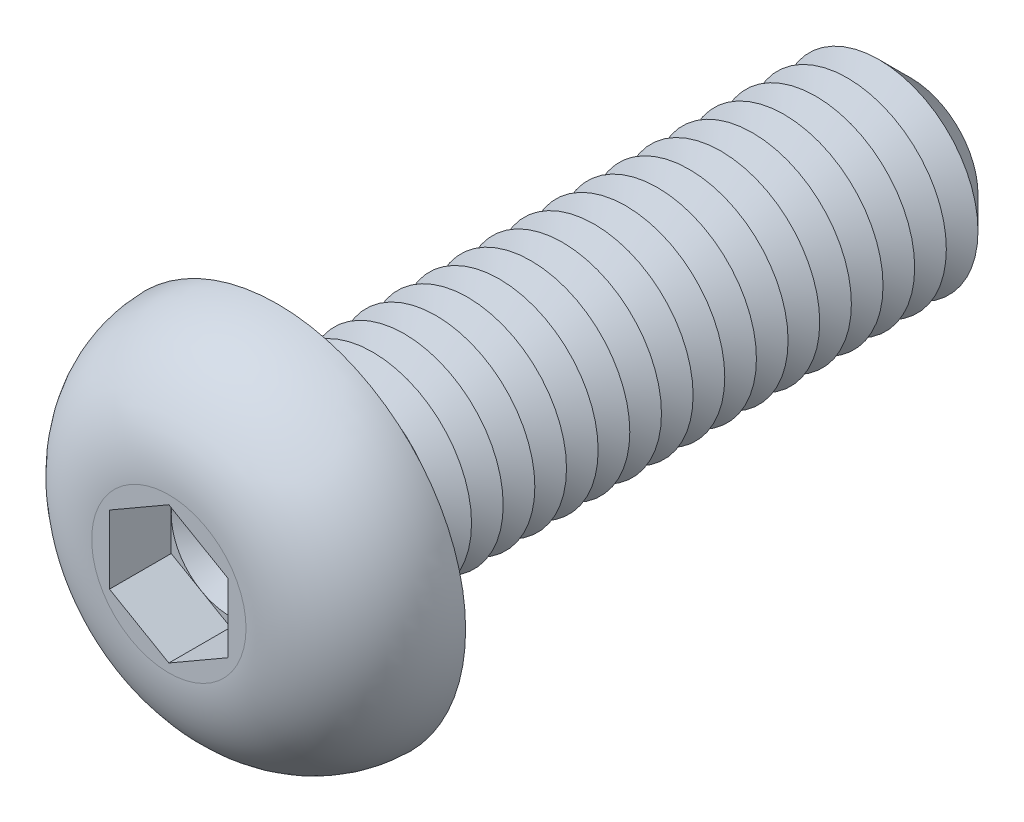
from build123d import *

# Parameters (mm, degrees)
CUT_EXTRUDE1_DEPTH  = 1.56
SKETCH4_R           = 2.5
BOSS_EXTRUDE1_DEPTH = 16
CHAMFER1_SIZE       = 0.8
LPATTERN1_COUNT     = 18
LPATTERN1_PITCH     = 0.8
FILLET2_R           = 0.4


with BuildPart() as part:
    # Sketch2 → Revolve1 (revolve)
    with BuildSketch(Plane(origin=(0, 0, 0), x_dir=(0, 0, -1), z_dir=(1, 0, 0)), mode=Mode.PRIVATE) as revolve1_sk:
        with BuildLine():
            Line((0, 0), (-2.75, 0))
            Line((-2.75, 0), (-2.75, 1.950446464))
            ThreePointArc((-2.75, 1.950446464), (-1.947498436, 3.912588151), (0, 4.75))
            Line((0, 4.75), (0, 0))
        make_face()
    revolve(revolve1_sk.sketch.rotate(Axis((0, 0, 47.934239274), (0, 0, -1)), 90), axis=Axis((0, 0, 47.934239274), (0, 0, -1)))

    # Sketch3 → Cut-Extrude1 (cut)
    with BuildSketch(Plane.XY.offset(2.75)):
        Polygon((0, 1.732050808), (-1.5, 0.866025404), (-1.5, -0.866025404), (0, -1.732050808), (1.5, -0.866025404), (1.5, 0.866025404), align=None)
    extrude(amount=-CUT_EXTRUDE1_DEPTH, mode=Mode.SUBTRACT)

    # Sketch4 → Boss-Extrude1 (add)
    with BuildSketch(Plane(origin=(0, 0, 0), x_dir=(-1, 0, 0), z_dir=(0, 0, -1))):
        with Locations(Location((0, 0, 0), (0, 0, 180))):
            Circle(SKETCH4_R)
    extrude(amount=BOSS_EXTRUDE1_DEPTH)

    # Chamfer1
    chamfer1_edges = [part.edges().sort_by_distance(p)[0] for p in [
        (-2.5, 0, -16),
    ]]
    chamfer(chamfer1_edges, length=CHAMFER1_SIZE)

    # Sketch5 → Cut-Revolve1 (revolve, cut)
    with BuildSketch(Plane(origin=(0, 0, 0), x_dir=(0, 0, -1), z_dir=(1, 0, 0)), mode=Mode.PRIVATE) as cut_revolve1_sk:
        Polygon((0.8, 2.5), (1.6, 2.5), (1.2, 1.807179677), align=None)
    cut_revolve1 = revolve(cut_revolve1_sk.sketch.rotate(Axis((0, 0, 47.934239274), (0, 0, -1)), 90), axis=Axis((0, 0, 47.934239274), (0, 0, -1)), mode=Mode.SUBTRACT)

    # LPattern1: Cut-Revolve1 ×18
    with Locations(*[(0, 0, -i * LPATTERN1_PITCH) for i in range(1, LPATTERN1_COUNT)]):
        add(cut_revolve1, mode=Mode.SUBTRACT)

    # Fillet2
    fillet2_edges = [part.edges().sort_by_distance(p)[0] for p in [
        (-2.5, 0, 0),
    ]]
    fillet(fillet2_edges, radius=FILLET2_R)

    # Cut-Extrude2 cone 1 section (on through the dimple's axis) → Cut-Extrude2 (revolve, cut)
    with BuildSketch(Plane(origin=(0, 0, 1.19), x_dir=(0, -1, 0), z_dir=(1, 0, 0))):
        Polygon((0, 0), (1.5, 0), (0, 0.866025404), align=None)
    revolve(axis=Axis((0, 0, 1.19), (0, 0, -1)), mode=Mode.SUBTRACT)


solid = part.part
